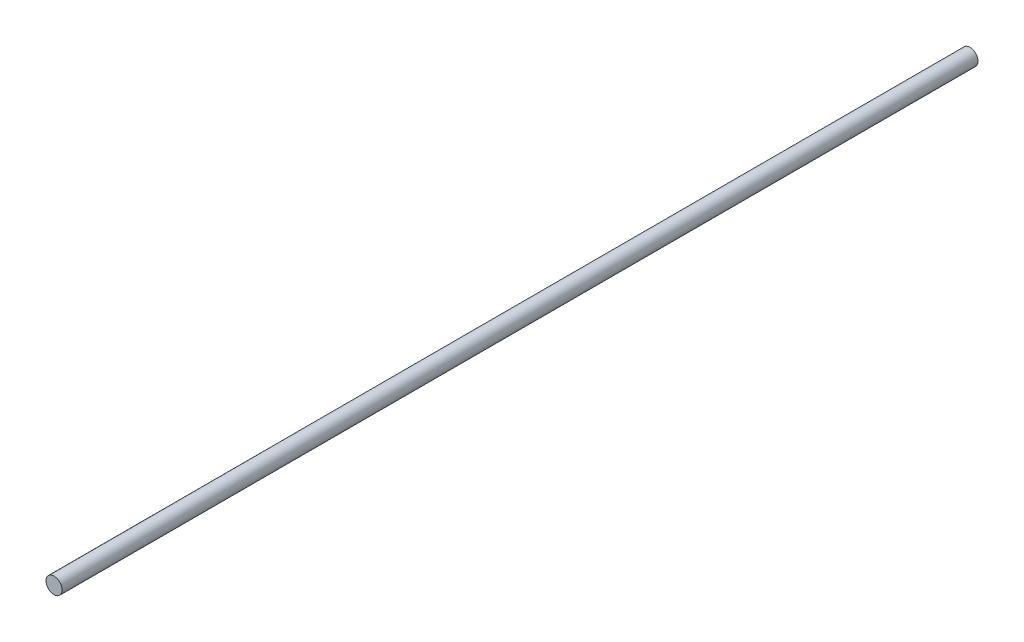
ISO-10303-21;
HEADER;
FILE_DESCRIPTION(('STEP AP214'),'2;1');
FILE_NAME('part.step','',(''),(''),'','','');
FILE_SCHEMA(('AUTOMOTIVE_DESIGN { 1 0 10303 214 1 1 1 1 }'));
ENDSEC;
DATA;
#1=APPLICATION_CONTEXT('core data for automotive mechanical design processes');
#2=APPLICATION_PROTOCOL_DEFINITION('international standard','automotive_design',2000,#1);
#3=PRODUCT_CONTEXT('',#1,'mechanical');
#4=PRODUCT('Part','Part','',(#3));
#5=PRODUCT_RELATED_PRODUCT_CATEGORY('part','',(#4));
#6=PRODUCT_DEFINITION_FORMATION('','',#4);
#7=PRODUCT_DEFINITION_CONTEXT('part definition',#1,'design');
#8=PRODUCT_DEFINITION('design','',#6,#7);
#9=PRODUCT_DEFINITION_SHAPE('','',#8);
#10=(LENGTH_UNIT() NAMED_UNIT(*) SI_UNIT(.MILLI.,.METRE.));
#11=(NAMED_UNIT(*) PLANE_ANGLE_UNIT() SI_UNIT($,.RADIAN.));
#12=(NAMED_UNIT(*) SI_UNIT($,.STERADIAN.) SOLID_ANGLE_UNIT());
#13=UNCERTAINTY_MEASURE_WITH_UNIT(LENGTH_MEASURE(1.E-05),#10,'distance_accuracy_value','');
#14=(GEOMETRIC_REPRESENTATION_CONTEXT(3) GLOBAL_UNCERTAINTY_ASSIGNED_CONTEXT((#13)) GLOBAL_UNIT_ASSIGNED_CONTEXT((#10,
#11,#12)) REPRESENTATION_CONTEXT('',''));
#15=CARTESIAN_POINT('',(0.,0.,0.));
#16=DIRECTION('',(0.,0.,1.));
#17=DIRECTION('',(1.,0.,0.));
#18=AXIS2_PLACEMENT_3D('',#15,#16,#17);
#19=CARTESIAN_POINT('',(0.,0.,340.5));
#20=DIRECTION('',(0.,0.,-1.));
#21=DIRECTION('',(-1.,0.,0.));
#22=AXIS2_PLACEMENT_3D('',#19,#20,#21);
#23=CYLINDRICAL_SURFACE('',#22,3.);
#24=CARTESIAN_POINT('',(0.,0.,340.5));
#25=DIRECTION('',(0.,0.,1.));
#26=DIRECTION('',(1.,0.,0.));
#27=AXIS2_PLACEMENT_3D('',#24,#25,#26);
#28=CIRCLE('',#27,3.);
#29=CARTESIAN_POINT('',(3.,0.,340.5));
#30=VERTEX_POINT('',#29);
#31=EDGE_CURVE('E10',#30,#30,#28,.T.);
#32=ORIENTED_EDGE('',*,*,#31,.F.);
#33=EDGE_LOOP('',(#32));
#34=FACE_BOUND('',#33,.T.);
#35=CARTESIAN_POINT('',(0.,0.,0.));
#36=DIRECTION('',(0.,0.,1.));
#37=DIRECTION('',(1.,0.,0.));
#38=AXIS2_PLACEMENT_3D('',#35,#36,#37);
#39=CIRCLE('',#38,3.);
#40=CARTESIAN_POINT('',(3.,0.,0.));
#41=VERTEX_POINT('',#40);
#42=EDGE_CURVE('E42',#41,#41,#39,.T.);
#43=ORIENTED_EDGE('',*,*,#42,.T.);
#44=EDGE_LOOP('',(#43));
#45=FACE_BOUND('',#44,.T.);
#46=ADVANCED_FACE('F39',(#34,#45),#23,.T.);
#47=CARTESIAN_POINT('',(0.,0.,340.5));
#48=DIRECTION('',(0.,0.,1.));
#49=DIRECTION('',(1.,0.,0.));
#50=AXIS2_PLACEMENT_3D('',#47,#48,#49);
#51=PLANE('',#50);
#52=ORIENTED_EDGE('',*,*,#31,.T.);
#53=EDGE_LOOP('',(#52));
#54=FACE_BOUND('',#53,.T.);
#55=ADVANCED_FACE('F54',(#54),#51,.T.);
#56=CARTESIAN_POINT('',(0.,0.,0.));
#57=DIRECTION('',(0.,0.,1.));
#58=DIRECTION('',(1.,0.,0.));
#59=AXIS2_PLACEMENT_3D('',#56,#57,#58);
#60=PLANE('',#59);
#61=ORIENTED_EDGE('',*,*,#42,.F.);
#62=EDGE_LOOP('',(#61));
#63=FACE_BOUND('',#62,.T.);
#64=ADVANCED_FACE('F52',(#63),#60,.F.);
#65=CLOSED_SHELL('',(#46,#55,#64));
#66=MANIFOLD_SOLID_BREP('B2',#65);
#67=ADVANCED_BREP_SHAPE_REPRESENTATION('',(#18,#66),#14);
#68=SHAPE_DEFINITION_REPRESENTATION(#9,#67);
ENDSEC;
END-ISO-10303-21;
